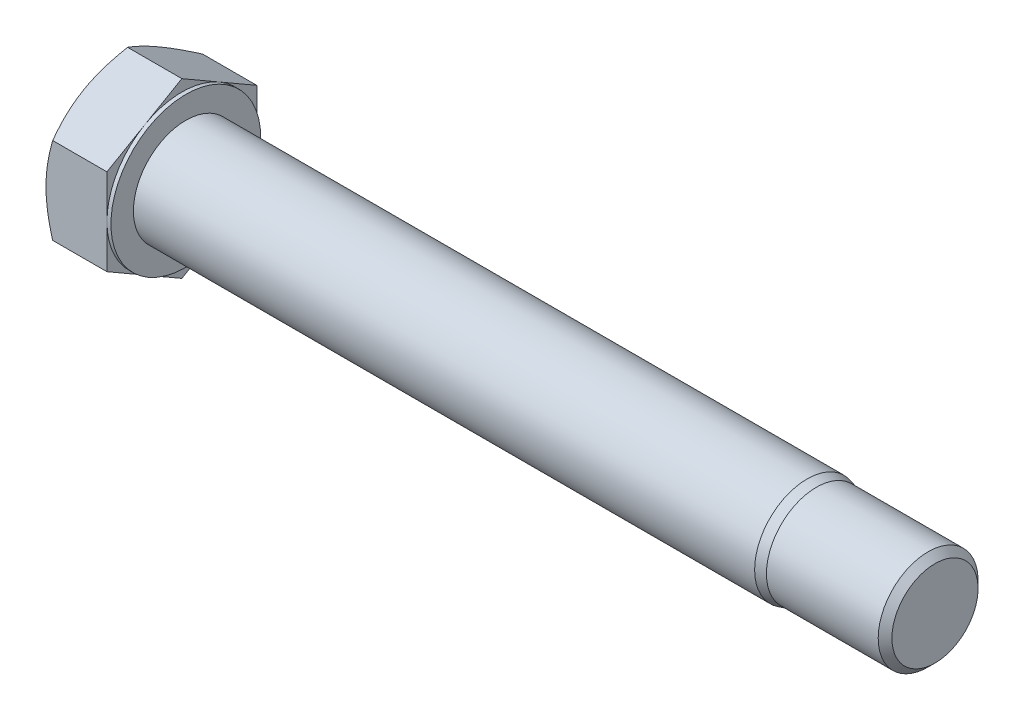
from build123d import *

# Parameters (mm, degrees)
BASEHEAD_DEPTH = 13
BEARINGSKE_W   = 0.8
BEARINGSKE_H   = 2.320508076


with BuildPart() as part:
    # HeadSke → BaseHead (new body)
    with BuildSketch(Plane(origin=(0, 0, 0), x_dir=(0, 0, -1), z_dir=(1, 0, 0))):
        Polygon((15, 8.660254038), (15, -8.660254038), (0, -17.320508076), (-15, -8.660254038), (-15, 8.660254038), (0, 17.320508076), align=None)
    extrude(amount=BASEHEAD_DEPTH)

    # BodySke → BaseBody (revolve)
    with BuildSketch(Plane.XY, mode=Mode.PRIVATE) as basebody_sk:
        Polygon((0, 10.5), (0, 0), (163, 0), (163, 8.626), (161.626, 10), (139.25, 10), (137.383974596, 10.5), align=None)
    revolve(basebody_sk.sketch.rotate(Axis((0, 0, 0), (1, 0, 0)), 90), axis=Axis((0, 0, 0), (1, 0, 0)))

    # Sketch3 → HeadChamfer (revolve, cut)
    with BuildSketch(Plane(origin=(0, 0, 0), x_dir=(1, 0, 0), z_dir=(0, 1, 0))):
        Polygon((3.75, 21.495190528), (-3.75, 8.504809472), (-13.695781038, 14.247008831), (-6.195781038, 27.237389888), align=None)
    revolve(axis=Axis((0, 0, 0), (1, 0, 0)), mode=Mode.SUBTRACT)

    # BearingSke → BearingFace (revolve, cut)
    with BuildSketch(Plane.XY, mode=Mode.PRIVATE) as bearingface_sk:
        with Locations((12.6, 16.160254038)):
            Rectangle(BEARINGSKE_W, BEARINGSKE_H)
    revolve(bearingface_sk.sketch.rotate(Axis((0, 0, 0), (1, 0, 0)), 270), axis=Axis((0, 0, 0), (1, 0, 0)), mode=Mode.SUBTRACT)


solid = part.part
